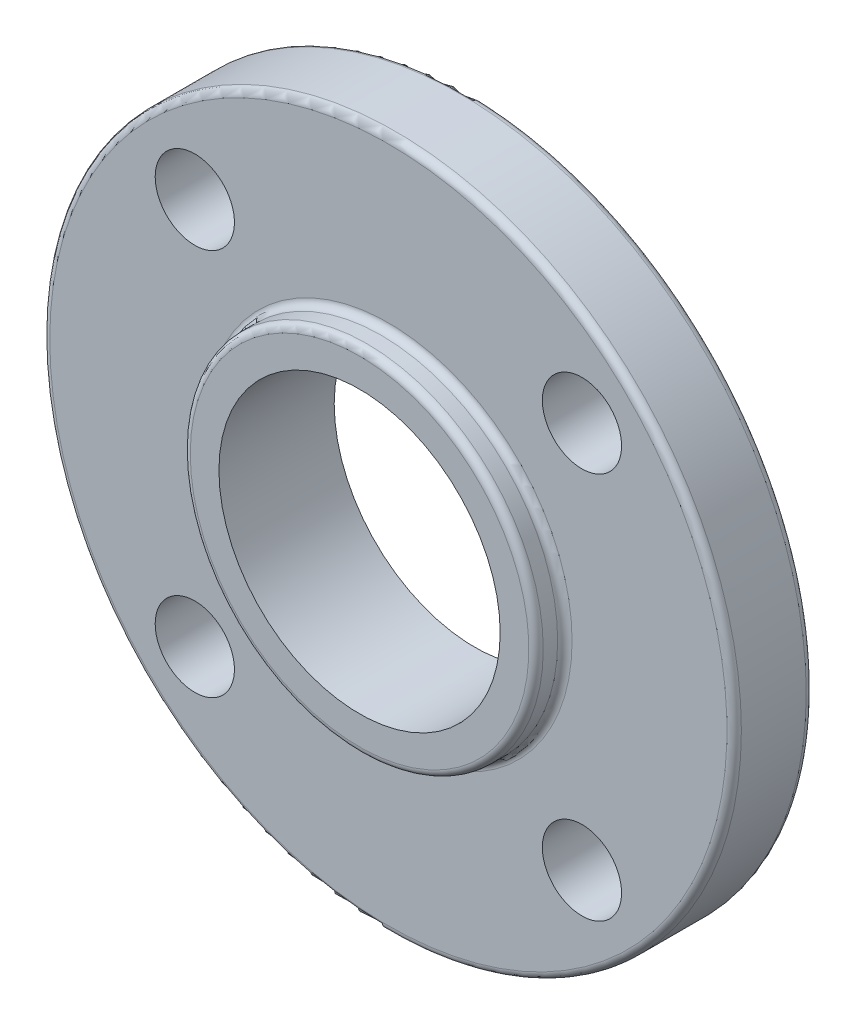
ISO-10303-21;
HEADER;
FILE_DESCRIPTION(('STEP AP214'),'2;1');
FILE_NAME('part.step','',(''),(''),'','','');
FILE_SCHEMA(('AUTOMOTIVE_DESIGN { 1 0 10303 214 1 1 1 1 }'));
ENDSEC;
DATA;
#1=APPLICATION_CONTEXT('core data for automotive mechanical design processes');
#2=APPLICATION_PROTOCOL_DEFINITION('international standard','automotive_design',2000,#1);
#3=PRODUCT_CONTEXT('',#1,'mechanical');
#4=PRODUCT('Part','Part','',(#3));
#5=PRODUCT_RELATED_PRODUCT_CATEGORY('part','',(#4));
#6=PRODUCT_DEFINITION_FORMATION('','',#4);
#7=PRODUCT_DEFINITION_CONTEXT('part definition',#1,'design');
#8=PRODUCT_DEFINITION('design','',#6,#7);
#9=PRODUCT_DEFINITION_SHAPE('','',#8);
#10=(LENGTH_UNIT() NAMED_UNIT(*) SI_UNIT(.MILLI.,.METRE.));
#11=(NAMED_UNIT(*) PLANE_ANGLE_UNIT() SI_UNIT($,.RADIAN.));
#12=(NAMED_UNIT(*) SI_UNIT($,.STERADIAN.) SOLID_ANGLE_UNIT());
#13=UNCERTAINTY_MEASURE_WITH_UNIT(LENGTH_MEASURE(1.E-05),#10,'distance_accuracy_value','');
#14=(GEOMETRIC_REPRESENTATION_CONTEXT(3) GLOBAL_UNCERTAINTY_ASSIGNED_CONTEXT((#13)) GLOBAL_UNIT_ASSIGNED_CONTEXT((#10,
#11,#12)) REPRESENTATION_CONTEXT('',''));
#15=CARTESIAN_POINT('',(0.,0.,0.));
#16=DIRECTION('',(0.,0.,1.));
#17=DIRECTION('',(1.,0.,0.));
#18=AXIS2_PLACEMENT_3D('',#15,#16,#17);
#19=CARTESIAN_POINT('',(30.9880000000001,0.,25.3999999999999));
#20=DIRECTION('',(0.,0.,-1.));
#21=DIRECTION('',(-1.,0.,0.));
#22=AXIS2_PLACEMENT_3D('',#19,#20,#21);
#23=PLANE('',#22);
#24=CARTESIAN_POINT('',(0.,0.,25.3999999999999));
#25=DIRECTION('',(0.,0.,-1.));
#26=DIRECTION('',(-1.,0.,0.));
#27=AXIS2_PLACEMENT_3D('',#24,#25,#26);
#28=CIRCLE('',#27,37.30625);
#29=CARTESIAN_POINT('',(-37.30625,0.,25.3999999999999));
#30=VERTEX_POINT('',#29);
#31=EDGE_CURVE('E10',#30,#30,#28,.T.);
#32=ORIENTED_EDGE('',*,*,#31,.F.);
#33=EDGE_LOOP('',(#32));
#34=FACE_BOUND('',#33,.T.);
#35=CARTESIAN_POINT('',(0.,0.,25.3999999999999));
#36=DIRECTION('',(0.,0.,-1.));
#37=DIRECTION('',(-1.,0.,0.));
#38=AXIS2_PLACEMENT_3D('',#35,#36,#37);
#39=CIRCLE('',#38,30.9880000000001);
#40=CARTESIAN_POINT('',(-30.9880000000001,0.,25.3999999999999));
#41=VERTEX_POINT('',#40);
#42=EDGE_CURVE('E77',#41,#41,#39,.T.);
#43=ORIENTED_EDGE('',*,*,#42,.T.);
#44=EDGE_LOOP('',(#43));
#45=FACE_BOUND('',#44,.T.);
#46=ADVANCED_FACE('F34',(#34,#45),#23,.F.);
#47=CARTESIAN_POINT('',(0.,0.,23.8125));
#48=DIRECTION('',(0.,0.,-1.));
#49=DIRECTION('',(-1.,0.,0.));
#50=AXIS2_PLACEMENT_3D('',#47,#48,#49);
#51=TOROIDAL_SURFACE('',#50,37.30625,1.58750000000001);
#52=CARTESIAN_POINT('',(0.,0.,23.8125));
#53=DIRECTION('',(0.,0.,-1.));
#54=DIRECTION('',(-1.,0.,0.));
#55=AXIS2_PLACEMENT_3D('',#52,#53,#54);
#56=CIRCLE('',#55,38.8937500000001);
#57=CARTESIAN_POINT('',(-38.8937500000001,0.,23.8125));
#58=VERTEX_POINT('',#57);
#59=EDGE_CURVE('E40',#58,#58,#56,.T.);
#60=ORIENTED_EDGE('',*,*,#59,.F.);
#61=EDGE_LOOP('',(#60));
#62=FACE_BOUND('',#61,.T.);
#63=ORIENTED_EDGE('',*,*,#31,.T.);
#64=EDGE_LOOP('',(#63));
#65=FACE_BOUND('',#64,.T.);
#66=ADVANCED_FACE('F156',(#62,#65),#51,.T.);
#67=CARTESIAN_POINT('',(0.,0.,-94.0937313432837));
#68=DIRECTION('',(0.,0.,-1.));
#69=DIRECTION('',(-1.,0.,0.));
#70=AXIS2_PLACEMENT_3D('',#67,#68,#69);
#71=CYLINDRICAL_SURFACE('',#70,38.8937500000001);
#72=CARTESIAN_POINT('',(0.,0.,20.6374999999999));
#73=DIRECTION('',(0.,0.,-1.));
#74=DIRECTION('',(-1.,0.,0.));
#75=AXIS2_PLACEMENT_3D('',#72,#73,#74);
#76=CIRCLE('',#75,38.89375);
#77=CARTESIAN_POINT('',(-38.89375,0.,20.6374999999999));
#78=VERTEX_POINT('',#77);
#79=EDGE_CURVE('E44',#78,#78,#76,.T.);
#80=ORIENTED_EDGE('',*,*,#79,.F.);
#81=EDGE_LOOP('',(#80));
#82=FACE_BOUND('',#81,.T.);
#83=ORIENTED_EDGE('',*,*,#59,.T.);
#84=EDGE_LOOP('',(#83));
#85=FACE_BOUND('',#84,.T.);
#86=ADVANCED_FACE('F151',(#82,#85),#71,.T.);
#87=CARTESIAN_POINT('',(0.,0.,20.6374999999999));
#88=DIRECTION('',(0.,0.,-1.));
#89=DIRECTION('',(-1.,0.,0.));
#90=AXIS2_PLACEMENT_3D('',#87,#88,#89);
#91=TOROIDAL_SURFACE('',#90,40.48125,1.58749999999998);
#92=CARTESIAN_POINT('',(0.,0.,19.05));
#93=DIRECTION('',(0.,0.,-1.));
#94=DIRECTION('',(-1.,0.,0.));
#95=AXIS2_PLACEMENT_3D('',#92,#93,#94);
#96=CIRCLE('',#95,40.48125);
#97=CARTESIAN_POINT('',(-40.48125,0.,19.05));
#98=VERTEX_POINT('',#97);
#99=EDGE_CURVE('E48',#98,#98,#96,.T.);
#100=ORIENTED_EDGE('',*,*,#99,.F.);
#101=EDGE_LOOP('',(#100));
#102=FACE_BOUND('',#101,.T.);
#103=ORIENTED_EDGE('',*,*,#79,.T.);
#104=EDGE_LOOP('',(#103));
#105=FACE_BOUND('',#104,.T.);
#106=ADVANCED_FACE('F144',(#102,#105),#91,.F.);
#107=CARTESIAN_POINT('',(74.6125000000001,0.,19.05));
#108=DIRECTION('',(0.,0.,-1.));
#109=DIRECTION('',(-1.,0.,0.));
#110=AXIS2_PLACEMENT_3D('',#107,#108,#109);
#111=PLANE('',#110);
#112=CARTESIAN_POINT('',(42.6562165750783,42.6562165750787,19.05));
#113=DIRECTION('',(0.,0.,-1.));
#114=DIRECTION('',(-1.,0.,0.));
#115=AXIS2_PLACEMENT_3D('',#112,#113,#114);
#116=CIRCLE('',#115,8.73125000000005);
#117=CARTESIAN_POINT('',(33.9249665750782,42.6562165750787,19.05));
#118=VERTEX_POINT('',#117);
#119=EDGE_CURVE('E98',#118,#118,#116,.T.);
#120=ORIENTED_EDGE('',*,*,#119,.T.);
#121=EDGE_LOOP('',(#120));
#122=FACE_BOUND('',#121,.T.);
#123=CARTESIAN_POINT('',(42.6562165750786,-42.6562165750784,19.05));
#124=DIRECTION('',(0.,0.,-1.));
#125=DIRECTION('',(-1.,0.,0.));
#126=AXIS2_PLACEMENT_3D('',#123,#124,#125);
#127=CIRCLE('',#126,8.73125000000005);
#128=CARTESIAN_POINT('',(33.9249665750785,-42.6562165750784,19.05));
#129=VERTEX_POINT('',#128);
#130=EDGE_CURVE('E92',#129,#129,#127,.T.);
#131=ORIENTED_EDGE('',*,*,#130,.T.);
#132=EDGE_LOOP('',(#131));
#133=FACE_BOUND('',#132,.T.);
#134=CARTESIAN_POINT('',(-42.6562165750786,-42.6562165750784,19.05));
#135=DIRECTION('',(0.,0.,-1.));
#136=DIRECTION('',(-1.,0.,0.));
#137=AXIS2_PLACEMENT_3D('',#134,#135,#136);
#138=CIRCLE('',#137,8.73125000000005);
#139=CARTESIAN_POINT('',(-51.3874665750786,-42.6562165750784,19.05));
#140=VERTEX_POINT('',#139);
#141=EDGE_CURVE('E86',#140,#140,#138,.T.);
#142=ORIENTED_EDGE('',*,*,#141,.T.);
#143=EDGE_LOOP('',(#142));
#144=FACE_BOUND('',#143,.T.);
#145=CARTESIAN_POINT('',(-42.6562165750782,42.6562165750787,19.05));
#146=DIRECTION('',(0.,0.,-1.));
#147=DIRECTION('',(-1.,0.,0.));
#148=AXIS2_PLACEMENT_3D('',#145,#146,#147);
#149=CIRCLE('',#148,8.73125000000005);
#150=CARTESIAN_POINT('',(-51.3874665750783,42.6562165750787,19.05));
#151=VERTEX_POINT('',#150);
#152=EDGE_CURVE('E80',#151,#151,#149,.T.);
#153=ORIENTED_EDGE('',*,*,#152,.T.);
#154=EDGE_LOOP('',(#153));
#155=FACE_BOUND('',#154,.T.);
#156=CARTESIAN_POINT('',(0.,0.,19.05));
#157=DIRECTION('',(0.,0.,-1.));
#158=DIRECTION('',(-1.,0.,0.));
#159=AXIS2_PLACEMENT_3D('',#156,#157,#158);
#160=CIRCLE('',#159,74.6125000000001);
#161=CARTESIAN_POINT('',(-74.6125000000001,0.,19.05));
#162=VERTEX_POINT('',#161);
#163=EDGE_CURVE('E53',#162,#162,#160,.T.);
#164=ORIENTED_EDGE('',*,*,#163,.F.);
#165=EDGE_LOOP('',(#164));
#166=FACE_BOUND('',#165,.T.);
#167=ORIENTED_EDGE('',*,*,#99,.T.);
#168=EDGE_LOOP('',(#167));
#169=FACE_BOUND('',#168,.T.);
#170=ADVANCED_FACE('F138',(#122,#133,#144,#155,#166,#169),#111,.F.);
#171=CARTESIAN_POINT('',(0.,0.,17.4625000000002));
#172=DIRECTION('',(0.,0.,-1.));
#173=DIRECTION('',(-1.,0.,0.));
#174=AXIS2_PLACEMENT_3D('',#171,#172,#173);
#175=TOROIDAL_SURFACE('',#174,74.6125000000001,1.58749999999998);
#176=CARTESIAN_POINT('',(0.,0.,17.4625000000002));
#177=DIRECTION('',(0.,0.,-1.));
#178=DIRECTION('',(-1.,0.,0.));
#179=AXIS2_PLACEMENT_3D('',#176,#177,#178);
#180=CIRCLE('',#179,76.2);
#181=CARTESIAN_POINT('',(-76.2,0.,17.4625000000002));
#182=VERTEX_POINT('',#181);
#183=EDGE_CURVE('E56',#182,#182,#180,.T.);
#184=ORIENTED_EDGE('',*,*,#183,.F.);
#185=EDGE_LOOP('',(#184));
#186=FACE_BOUND('',#185,.T.);
#187=ORIENTED_EDGE('',*,*,#163,.T.);
#188=EDGE_LOOP('',(#187));
#189=FACE_BOUND('',#188,.T.);
#190=ADVANCED_FACE('F132',(#186,#189),#175,.T.);
#191=CARTESIAN_POINT('',(0.,0.,-94.0937313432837));
#192=DIRECTION('',(0.,0.,-1.));
#193=DIRECTION('',(-1.,0.,0.));
#194=AXIS2_PLACEMENT_3D('',#191,#192,#193);
#195=CYLINDRICAL_SURFACE('',#194,76.2);
#196=CARTESIAN_POINT('',(0.,0.,3.17500000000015));
#197=DIRECTION('',(0.,0.,-1.));
#198=DIRECTION('',(-1.,0.,0.));
#199=AXIS2_PLACEMENT_3D('',#196,#197,#198);
#200=CIRCLE('',#199,76.2000000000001);
#201=CARTESIAN_POINT('',(-76.2000000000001,0.,3.17500000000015));
#202=VERTEX_POINT('',#201);
#203=EDGE_CURVE('E59',#202,#202,#200,.T.);
#204=ORIENTED_EDGE('',*,*,#203,.F.);
#205=EDGE_LOOP('',(#204));
#206=FACE_BOUND('',#205,.T.);
#207=ORIENTED_EDGE('',*,*,#183,.T.);
#208=EDGE_LOOP('',(#207));
#209=FACE_BOUND('',#208,.T.);
#210=ADVANCED_FACE('F126',(#206,#209),#195,.T.);
#211=CARTESIAN_POINT('',(0.,0.,3.17500000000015));
#212=DIRECTION('',(0.,0.,-1.));
#213=DIRECTION('',(-1.,0.,0.));
#214=AXIS2_PLACEMENT_3D('',#211,#212,#213);
#215=TOROIDAL_SURFACE('',#214,74.6125000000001,1.58749999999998);
#216=CARTESIAN_POINT('',(0.,0.,1.58749999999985));
#217=DIRECTION('',(0.,0.,-1.));
#218=DIRECTION('',(-1.,0.,0.));
#219=AXIS2_PLACEMENT_3D('',#216,#217,#218);
#220=CIRCLE('',#219,74.6125000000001);
#221=CARTESIAN_POINT('',(-74.6125000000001,0.,1.58749999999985));
#222=VERTEX_POINT('',#221);
#223=EDGE_CURVE('E62',#222,#222,#220,.T.);
#224=ORIENTED_EDGE('',*,*,#223,.F.);
#225=EDGE_LOOP('',(#224));
#226=FACE_BOUND('',#225,.T.);
#227=ORIENTED_EDGE('',*,*,#203,.T.);
#228=EDGE_LOOP('',(#227));
#229=FACE_BOUND('',#228,.T.);
#230=ADVANCED_FACE('F112',(#226,#229),#215,.T.);
#231=CARTESIAN_POINT('',(47.5615,0.,1.58749999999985));
#232=DIRECTION('',(0.,0.,1.));
#233=DIRECTION('',(1.,0.,0.));
#234=AXIS2_PLACEMENT_3D('',#231,#232,#233);
#235=PLANE('',#234);
#236=CARTESIAN_POINT('',(42.6562165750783,42.6562165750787,1.58749999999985));
#237=DIRECTION('',(0.,0.,-1.));
#238=DIRECTION('',(0.,1.,0.));
#239=AXIS2_PLACEMENT_3D('',#236,#237,#238);
#240=CIRCLE('',#239,8.73125000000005);
#241=CARTESIAN_POINT('',(42.6562165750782,51.3874665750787,1.58749999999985));
#242=VERTEX_POINT('',#241);
#243=EDGE_CURVE('E101',#242,#242,#240,.T.);
#244=ORIENTED_EDGE('',*,*,#243,.F.);
#245=EDGE_LOOP('',(#244));
#246=FACE_BOUND('',#245,.T.);
#247=CARTESIAN_POINT('',(42.6562165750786,-42.6562165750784,1.58749999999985));
#248=DIRECTION('',(0.,0.,-1.));
#249=DIRECTION('',(1.,0.,0.));
#250=AXIS2_PLACEMENT_3D('',#247,#248,#249);
#251=CIRCLE('',#250,8.73125000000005);
#252=CARTESIAN_POINT('',(51.3874665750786,-42.6562165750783,1.58749999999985));
#253=VERTEX_POINT('',#252);
#254=EDGE_CURVE('E95',#253,#253,#251,.T.);
#255=ORIENTED_EDGE('',*,*,#254,.F.);
#256=EDGE_LOOP('',(#255));
#257=FACE_BOUND('',#256,.T.);
#258=CARTESIAN_POINT('',(-42.6562165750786,-42.6562165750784,1.58749999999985));
#259=DIRECTION('',(0.,0.,-1.));
#260=DIRECTION('',(0.,-1.,0.));
#261=AXIS2_PLACEMENT_3D('',#258,#259,#260);
#262=CIRCLE('',#261,8.73125000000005);
#263=CARTESIAN_POINT('',(-42.6562165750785,-51.3874665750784,1.58749999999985));
#264=VERTEX_POINT('',#263);
#265=EDGE_CURVE('E89',#264,#264,#262,.T.);
#266=ORIENTED_EDGE('',*,*,#265,.F.);
#267=EDGE_LOOP('',(#266));
#268=FACE_BOUND('',#267,.T.);
#269=CARTESIAN_POINT('',(-42.6562165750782,42.6562165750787,1.58749999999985));
#270=DIRECTION('',(0.,0.,-1.));
#271=DIRECTION('',(-1.,0.,0.));
#272=AXIS2_PLACEMENT_3D('',#269,#270,#271);
#273=CIRCLE('',#272,8.73125000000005);
#274=CARTESIAN_POINT('',(-51.3874665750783,42.6562165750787,1.58749999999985));
#275=VERTEX_POINT('',#274);
#276=EDGE_CURVE('E83',#275,#275,#273,.T.);
#277=ORIENTED_EDGE('',*,*,#276,.F.);
#278=EDGE_LOOP('',(#277));
#279=FACE_BOUND('',#278,.T.);
#280=CARTESIAN_POINT('',(0.,0.,1.58749999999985));
#281=DIRECTION('',(0.,0.,-1.));
#282=DIRECTION('',(-1.,0.,0.));
#283=AXIS2_PLACEMENT_3D('',#280,#281,#282);
#284=CIRCLE('',#283,47.5615);
#285=CARTESIAN_POINT('',(-47.5615,0.,1.58749999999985));
#286=VERTEX_POINT('',#285);
#287=EDGE_CURVE('E65',#286,#286,#284,.T.);
#288=ORIENTED_EDGE('',*,*,#287,.F.);
#289=EDGE_LOOP('',(#288));
#290=FACE_BOUND('',#289,.T.);
#291=ORIENTED_EDGE('',*,*,#223,.T.);
#292=EDGE_LOOP('',(#291));
#293=FACE_BOUND('',#292,.T.);
#294=ADVANCED_FACE('F108',(#246,#257,#268,#279,#290,#293),#235,.F.);
#295=CARTESIAN_POINT('',(0.,0.,0.0634999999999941));
#296=DIRECTION('',(0.,0.,-1.));
#297=DIRECTION('',(-1.,0.,0.));
#298=AXIS2_PLACEMENT_3D('',#295,#296,#297);
#299=TOROIDAL_SURFACE('',#298,47.5615,1.52400000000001);
#300=CARTESIAN_POINT('',(0.,0.,0.0634999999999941));
#301=DIRECTION('',(0.,0.,-1.));
#302=DIRECTION('',(-1.,0.,0.));
#303=AXIS2_PLACEMENT_3D('',#300,#301,#302);
#304=CIRCLE('',#303,46.0375);
#305=CARTESIAN_POINT('',(-46.0375,0.,0.0634999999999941));
#306=VERTEX_POINT('',#305);
#307=EDGE_CURVE('E68',#306,#306,#304,.T.);
#308=ORIENTED_EDGE('',*,*,#307,.F.);
#309=EDGE_LOOP('',(#308));
#310=FACE_BOUND('',#309,.T.);
#311=ORIENTED_EDGE('',*,*,#287,.T.);
#312=EDGE_LOOP('',(#311));
#313=FACE_BOUND('',#312,.T.);
#314=ADVANCED_FACE('F111',(#310,#313),#299,.F.);
#315=CARTESIAN_POINT('',(0.,0.,-94.0937313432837));
#316=DIRECTION('',(0.,0.,-1.));
#317=DIRECTION('',(-1.,0.,0.));
#318=AXIS2_PLACEMENT_3D('',#315,#316,#317);
#319=CYLINDRICAL_SURFACE('',#318,46.0375);
#320=CARTESIAN_POINT('',(0.,0.,0.));
#321=DIRECTION('',(0.,0.,-1.));
#322=DIRECTION('',(-1.,0.,0.));
#323=AXIS2_PLACEMENT_3D('',#320,#321,#322);
#324=CIRCLE('',#323,46.0375);
#325=CARTESIAN_POINT('',(-46.0375,0.,0.));
#326=VERTEX_POINT('',#325);
#327=EDGE_CURVE('E71',#326,#326,#324,.T.);
#328=ORIENTED_EDGE('',*,*,#327,.F.);
#329=EDGE_LOOP('',(#328));
#330=FACE_BOUND('',#329,.T.);
#331=ORIENTED_EDGE('',*,*,#307,.T.);
#332=EDGE_LOOP('',(#331));
#333=FACE_BOUND('',#332,.T.);
#334=ADVANCED_FACE('F179',(#330,#333),#319,.T.);
#335=CARTESIAN_POINT('',(30.9880000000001,0.,0.));
#336=DIRECTION('',(0.,0.,1.));
#337=DIRECTION('',(1.,0.,0.));
#338=AXIS2_PLACEMENT_3D('',#335,#336,#337);
#339=PLANE('',#338);
#340=CARTESIAN_POINT('',(0.,0.,0.));
#341=DIRECTION('',(0.,0.,-1.));
#342=DIRECTION('',(-1.,0.,0.));
#343=AXIS2_PLACEMENT_3D('',#340,#341,#342);
#344=CIRCLE('',#343,30.9880000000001);
#345=CARTESIAN_POINT('',(-30.9880000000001,0.,0.));
#346=VERTEX_POINT('',#345);
#347=EDGE_CURVE('E74',#346,#346,#344,.T.);
#348=ORIENTED_EDGE('',*,*,#347,.F.);
#349=EDGE_LOOP('',(#348));
#350=FACE_BOUND('',#349,.T.);
#351=ORIENTED_EDGE('',*,*,#327,.T.);
#352=EDGE_LOOP('',(#351));
#353=FACE_BOUND('',#352,.T.);
#354=ADVANCED_FACE('F173',(#350,#353),#339,.F.);
#355=CARTESIAN_POINT('',(0.,0.,-94.0937313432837));
#356=DIRECTION('',(0.,0.,-1.));
#357=DIRECTION('',(-1.,0.,0.));
#358=AXIS2_PLACEMENT_3D('',#355,#356,#357);
#359=CYLINDRICAL_SURFACE('',#358,30.9880000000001);
#360=ORIENTED_EDGE('',*,*,#42,.F.);
#361=EDGE_LOOP('',(#360));
#362=FACE_BOUND('',#361,.T.);
#363=ORIENTED_EDGE('',*,*,#347,.T.);
#364=EDGE_LOOP('',(#363));
#365=FACE_BOUND('',#364,.T.);
#366=ADVANCED_FACE('F169',(#362,#365),#359,.F.);
#367=CARTESIAN_POINT('',(-42.6562165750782,42.6562165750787,25.3999999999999));
#368=DIRECTION('',(0.,0.,-1.));
#369=DIRECTION('',(-1.,0.,0.));
#370=AXIS2_PLACEMENT_3D('',#367,#368,#369);
#371=CYLINDRICAL_SURFACE('',#370,8.73125000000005);
#372=ORIENTED_EDGE('',*,*,#276,.T.);
#373=EDGE_LOOP('',(#372));
#374=FACE_BOUND('',#373,.T.);
#375=ORIENTED_EDGE('',*,*,#152,.F.);
#376=EDGE_LOOP('',(#375));
#377=FACE_BOUND('',#376,.T.);
#378=ADVANCED_FACE('F172',(#374,#377),#371,.F.);
#379=CARTESIAN_POINT('',(-42.6562165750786,-42.6562165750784,25.3999999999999));
#380=DIRECTION('',(0.,0.,-1.));
#381=DIRECTION('',(-1.,0.,0.));
#382=AXIS2_PLACEMENT_3D('',#379,#380,#381);
#383=CYLINDRICAL_SURFACE('',#382,8.73125000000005);
#384=ORIENTED_EDGE('',*,*,#265,.T.);
#385=EDGE_LOOP('',(#384));
#386=FACE_BOUND('',#385,.T.);
#387=ORIENTED_EDGE('',*,*,#141,.F.);
#388=EDGE_LOOP('',(#387));
#389=FACE_BOUND('',#388,.T.);
#390=ADVANCED_FACE('F196',(#386,#389),#383,.F.);
#391=CARTESIAN_POINT('',(42.6562165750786,-42.6562165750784,25.3999999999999));
#392=DIRECTION('',(0.,0.,-1.));
#393=DIRECTION('',(-1.,0.,0.));
#394=AXIS2_PLACEMENT_3D('',#391,#392,#393);
#395=CYLINDRICAL_SURFACE('',#394,8.73125000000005);
#396=ORIENTED_EDGE('',*,*,#254,.T.);
#397=EDGE_LOOP('',(#396));
#398=FACE_BOUND('',#397,.T.);
#399=ORIENTED_EDGE('',*,*,#130,.F.);
#400=EDGE_LOOP('',(#399));
#401=FACE_BOUND('',#400,.T.);
#402=ADVANCED_FACE('F200',(#398,#401),#395,.F.);
#403=CARTESIAN_POINT('',(42.6562165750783,42.6562165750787,25.3999999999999));
#404=DIRECTION('',(0.,0.,-1.));
#405=DIRECTION('',(-1.,0.,0.));
#406=AXIS2_PLACEMENT_3D('',#403,#404,#405);
#407=CYLINDRICAL_SURFACE('',#406,8.73125000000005);
#408=ORIENTED_EDGE('',*,*,#243,.T.);
#409=EDGE_LOOP('',(#408));
#410=FACE_BOUND('',#409,.T.);
#411=ORIENTED_EDGE('',*,*,#119,.F.);
#412=EDGE_LOOP('',(#411));
#413=FACE_BOUND('',#412,.T.);
#414=ADVANCED_FACE('F105',(#410,#413),#407,.F.);
#415=CLOSED_SHELL('',(#46,#66,#86,#106,#170,#190,#210,#230,#294,#314,#334,#354,#366,#378,#390,
#402,#414));
#416=MANIFOLD_SOLID_BREP('B2',#415);
#417=ADVANCED_BREP_SHAPE_REPRESENTATION('',(#18,#416),#14);
#418=SHAPE_DEFINITION_REPRESENTATION(#9,#417);
ENDSEC;
END-ISO-10303-21;
